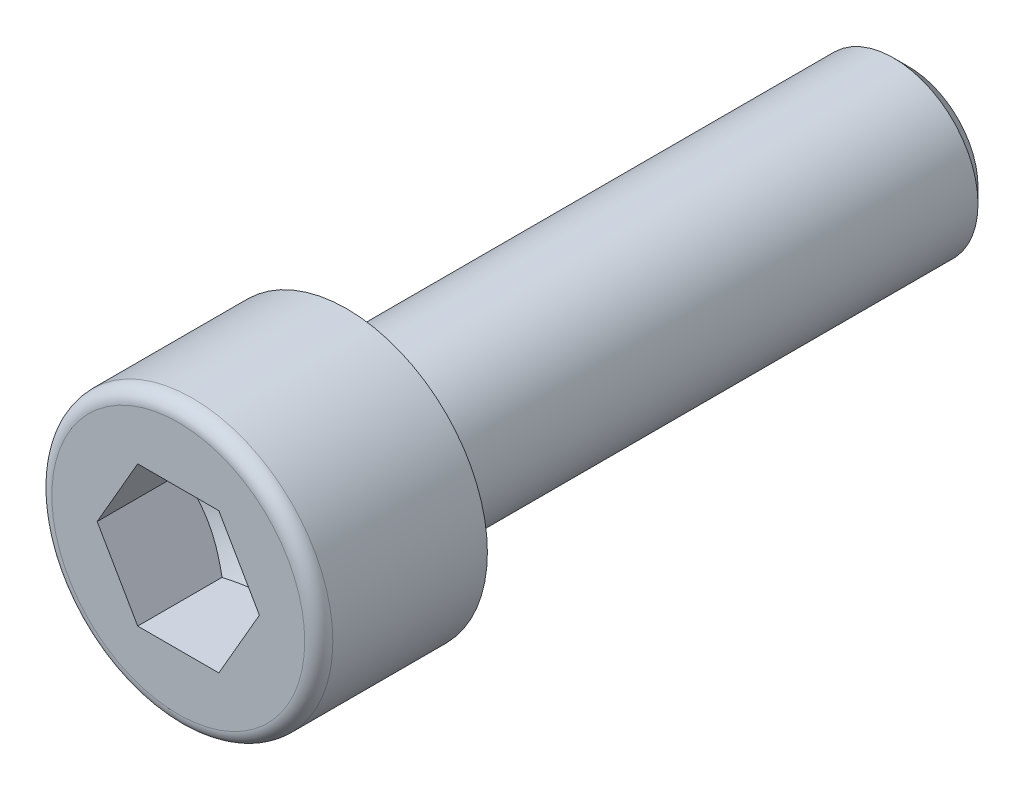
ISO-10303-21;
HEADER;
FILE_DESCRIPTION(('STEP AP214'),'2;1');
FILE_NAME('part.step','',(''),(''),'','','');
FILE_SCHEMA(('AUTOMOTIVE_DESIGN { 1 0 10303 214 1 1 1 1 }'));
ENDSEC;
DATA;
#1=APPLICATION_CONTEXT('core data for automotive mechanical design processes');
#2=APPLICATION_PROTOCOL_DEFINITION('international standard','automotive_design',2000,#1);
#3=PRODUCT_CONTEXT('',#1,'mechanical');
#4=PRODUCT('Part','Part','',(#3));
#5=PRODUCT_RELATED_PRODUCT_CATEGORY('part','',(#4));
#6=PRODUCT_DEFINITION_FORMATION('','',#4);
#7=PRODUCT_DEFINITION_CONTEXT('part definition',#1,'design');
#8=PRODUCT_DEFINITION('design','',#6,#7);
#9=PRODUCT_DEFINITION_SHAPE('','',#8);
#10=(LENGTH_UNIT() NAMED_UNIT(*) SI_UNIT(.MILLI.,.METRE.));
#11=(NAMED_UNIT(*) PLANE_ANGLE_UNIT() SI_UNIT($,.RADIAN.));
#12=(NAMED_UNIT(*) SI_UNIT($,.STERADIAN.) SOLID_ANGLE_UNIT());
#13=UNCERTAINTY_MEASURE_WITH_UNIT(LENGTH_MEASURE(1.E-05),#10,'distance_accuracy_value','');
#14=(GEOMETRIC_REPRESENTATION_CONTEXT(3) GLOBAL_UNCERTAINTY_ASSIGNED_CONTEXT((#13)) GLOBAL_UNIT_ASSIGNED_CONTEXT((#10,
#11,#12)) REPRESENTATION_CONTEXT('',''));
#15=CARTESIAN_POINT('',(0.,0.,0.));
#16=DIRECTION('',(0.,0.,1.));
#17=DIRECTION('',(1.,0.,0.));
#18=AXIS2_PLACEMENT_3D('',#15,#16,#17);
#19=CARTESIAN_POINT('',(0.,0.,6.));
#20=DIRECTION('',(0.,0.,1.));
#21=DIRECTION('',(1.,0.,0.));
#22=AXIS2_PLACEMENT_3D('',#19,#20,#21);
#23=PLANE('',#22);
#24=CARTESIAN_POINT('',(0.,0.,6.));
#25=DIRECTION('',(0.,0.,1.));
#26=DIRECTION('',(1.,0.,0.));
#27=AXIS2_PLACEMENT_3D('',#24,#25,#26);
#28=CIRCLE('',#27,4.5);
#29=CARTESIAN_POINT('',(4.5,0.,6.));
#30=VERTEX_POINT('',#29);
#31=EDGE_CURVE('E118',#30,#30,#28,.T.);
#32=ORIENTED_EDGE('',*,*,#31,.T.);
#33=EDGE_LOOP('',(#32));
#34=FACE_BOUND('',#33,.T.);
#35=DIRECTION('',(1.,0.,0.));
#36=VECTOR('',#35,1.);
#37=CARTESIAN_POINT('',(-1.443375,2.49999883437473,6.));
#38=LINE('',#37,#36);
#39=CARTESIAN_POINT('',(-1.443375,2.49999883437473,6.));
#40=VERTEX_POINT('',#39);
#41=CARTESIAN_POINT('',(1.443375,2.49999883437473,6.));
#42=VERTEX_POINT('',#41);
#43=EDGE_CURVE('E95',#40,#42,#38,.T.);
#44=ORIENTED_EDGE('',*,*,#43,.T.);
#45=DIRECTION('',(0.5,-0.866025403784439,0.));
#46=VECTOR('',#45,1.);
#47=CARTESIAN_POINT('',(1.443375,2.49999883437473,6.));
#48=LINE('',#47,#46);
#49=CARTESIAN_POINT('',(2.88675,0.,6.));
#50=VERTEX_POINT('',#49);
#51=EDGE_CURVE('E32',#42,#50,#48,.T.);
#52=ORIENTED_EDGE('',*,*,#51,.T.);
#53=DIRECTION('',(-0.5,-0.866025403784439,0.));
#54=VECTOR('',#53,1.);
#55=CARTESIAN_POINT('',(2.88675,0.,6.));
#56=LINE('',#55,#54);
#57=CARTESIAN_POINT('',(1.443375,-2.49999883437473,6.));
#58=VERTEX_POINT('',#57);
#59=EDGE_CURVE('E375',#50,#58,#56,.T.);
#60=ORIENTED_EDGE('',*,*,#59,.T.);
#61=DIRECTION('',(-1.,0.,0.));
#62=VECTOR('',#61,1.);
#63=CARTESIAN_POINT('',(1.443375,-2.49999883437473,6.));
#64=LINE('',#63,#62);
#65=CARTESIAN_POINT('',(-1.443375,-2.49999883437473,6.));
#66=VERTEX_POINT('',#65);
#67=EDGE_CURVE('E379',#58,#66,#64,.T.);
#68=ORIENTED_EDGE('',*,*,#67,.T.);
#69=DIRECTION('',(-0.5,0.866025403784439,0.));
#70=VECTOR('',#69,1.);
#71=CARTESIAN_POINT('',(-1.443375,-2.49999883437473,6.));
#72=LINE('',#71,#70);
#73=CARTESIAN_POINT('',(-2.88675,0.,6.));
#74=VERTEX_POINT('',#73);
#75=EDGE_CURVE('E383',#66,#74,#72,.T.);
#76=ORIENTED_EDGE('',*,*,#75,.T.);
#77=DIRECTION('',(0.5,0.866025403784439,0.));
#78=VECTOR('',#77,1.);
#79=CARTESIAN_POINT('',(-2.88675,0.,6.));
#80=LINE('',#79,#78);
#81=EDGE_CURVE('E104',#74,#40,#80,.T.);
#82=ORIENTED_EDGE('',*,*,#81,.T.);
#83=EDGE_LOOP('',(#44,#52,#60,#68,#76,#82));
#84=FACE_BOUND('',#83,.T.);
#85=ADVANCED_FACE('F16',(#34,#84),#23,.T.);
#86=CARTESIAN_POINT('',(0.,2.45875,-20.));
#87=DIRECTION('',(0.,0.,-1.));
#88=DIRECTION('',(-1.,0.,0.));
#89=AXIS2_PLACEMENT_3D('',#86,#87,#88);
#90=PLANE('',#89);
#91=CARTESIAN_POINT('',(0.,0.,-20.));
#92=DIRECTION('',(0.,0.,1.));
#93=DIRECTION('',(1.,0.,0.));
#94=AXIS2_PLACEMENT_3D('',#91,#92,#93);
#95=CIRCLE('',#94,2.45875);
#96=CARTESIAN_POINT('',(2.45875,0.,-20.));
#97=VERTEX_POINT('',#96);
#98=EDGE_CURVE('E11',#97,#97,#95,.T.);
#99=ORIENTED_EDGE('',*,*,#98,.F.);
#100=EDGE_LOOP('',(#99));
#101=FACE_BOUND('',#100,.T.);
#102=ADVANCED_FACE('F18',(#101),#90,.T.);
#103=CARTESIAN_POINT('',(0.,0.,-19.45875));
#104=DIRECTION('',(0.,0.,1.));
#105=DIRECTION('',(1.,0.,0.));
#106=AXIS2_PLACEMENT_3D('',#103,#104,#105);
#107=CONICAL_SURFACE('',#106,3.,0.785398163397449);
#108=ORIENTED_EDGE('',*,*,#98,.T.);
#109=EDGE_LOOP('',(#108));
#110=FACE_BOUND('',#109,.T.);
#111=CARTESIAN_POINT('',(0.,0.,-19.45875));
#112=DIRECTION('',(0.,0.,1.));
#113=DIRECTION('',(1.,0.,0.));
#114=AXIS2_PLACEMENT_3D('',#111,#112,#113);
#115=CIRCLE('',#114,3.);
#116=CARTESIAN_POINT('',(3.,0.,-19.45875));
#117=VERTEX_POINT('',#116);
#118=EDGE_CURVE('E25',#117,#117,#115,.T.);
#119=ORIENTED_EDGE('',*,*,#118,.F.);
#120=EDGE_LOOP('',(#119));
#121=FACE_BOUND('',#120,.T.);
#122=ADVANCED_FACE('F159',(#110,#121),#107,.T.);
#123=CARTESIAN_POINT('',(0.,0.,6.));
#124=DIRECTION('',(0.,0.,1.));
#125=DIRECTION('',(1.,0.,0.));
#126=AXIS2_PLACEMENT_3D('',#123,#124,#125);
#127=CYLINDRICAL_SURFACE('',#126,3.);
#128=ORIENTED_EDGE('',*,*,#118,.T.);
#129=EDGE_LOOP('',(#128));
#130=FACE_BOUND('',#129,.T.);
#131=CARTESIAN_POINT('',(0.,0.,-0.89125));
#132=DIRECTION('',(0.,0.,1.));
#133=DIRECTION('',(1.,0.,0.));
#134=AXIS2_PLACEMENT_3D('',#131,#132,#133);
#135=CIRCLE('',#134,3.);
#136=CARTESIAN_POINT('',(3.,0.,-0.89125));
#137=VERTEX_POINT('',#136);
#138=EDGE_CURVE('E146',#137,#137,#135,.T.);
#139=ORIENTED_EDGE('',*,*,#138,.F.);
#140=EDGE_LOOP('',(#139));
#141=FACE_BOUND('',#140,.T.);
#142=ADVANCED_FACE('F156',(#130,#141),#127,.T.);
#143=CARTESIAN_POINT('',(0.,2.45875,-0.89125));
#144=DIRECTION('',(0.,0.,1.));
#145=DIRECTION('',(1.,0.,0.));
#146=AXIS2_PLACEMENT_3D('',#143,#144,#145);
#147=PLANE('',#146);
#148=ORIENTED_EDGE('',*,*,#138,.T.);
#149=EDGE_LOOP('',(#148));
#150=FACE_BOUND('',#149,.T.);
#151=CARTESIAN_POINT('',(0.,0.,-0.89125));
#152=DIRECTION('',(0.,0.,1.));
#153=DIRECTION('',(1.,0.,0.));
#154=AXIS2_PLACEMENT_3D('',#151,#152,#153);
#155=CIRCLE('',#154,2.45875);
#156=CARTESIAN_POINT('',(2.45875,0.,-0.89125));
#157=VERTEX_POINT('',#156);
#158=EDGE_CURVE('E142',#157,#157,#155,.T.);
#159=ORIENTED_EDGE('',*,*,#158,.F.);
#160=EDGE_LOOP('',(#159));
#161=FACE_BOUND('',#160,.T.);
#162=ADVANCED_FACE('F167',(#150,#161),#147,.T.);
#163=CARTESIAN_POINT('',(0.,0.,-0.35));
#164=DIRECTION('',(0.,0.,1.));
#165=DIRECTION('',(1.,0.,0.));
#166=AXIS2_PLACEMENT_3D('',#163,#164,#165);
#167=CONICAL_SURFACE('',#166,3.,0.785398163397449);
#168=ORIENTED_EDGE('',*,*,#158,.T.);
#169=EDGE_LOOP('',(#168));
#170=FACE_BOUND('',#169,.T.);
#171=CARTESIAN_POINT('',(0.,0.,-0.35));
#172=DIRECTION('',(0.,0.,1.));
#173=DIRECTION('',(1.,0.,0.));
#174=AXIS2_PLACEMENT_3D('',#171,#172,#173);
#175=CIRCLE('',#174,3.);
#176=CARTESIAN_POINT('',(3.,0.,-0.35));
#177=VERTEX_POINT('',#176);
#178=EDGE_CURVE('E138',#177,#177,#175,.T.);
#179=ORIENTED_EDGE('',*,*,#178,.F.);
#180=EDGE_LOOP('',(#179));
#181=FACE_BOUND('',#180,.T.);
#182=ADVANCED_FACE('F199',(#170,#181),#167,.T.);
#183=CARTESIAN_POINT('',(0.,0.,6.));
#184=DIRECTION('',(0.,0.,1.));
#185=DIRECTION('',(1.,0.,0.));
#186=AXIS2_PLACEMENT_3D('',#183,#184,#185);
#187=CYLINDRICAL_SURFACE('',#186,3.);
#188=ORIENTED_EDGE('',*,*,#178,.T.);
#189=EDGE_LOOP('',(#188));
#190=FACE_BOUND('',#189,.T.);
#191=CARTESIAN_POINT('',(0.,0.,-0.3));
#192=DIRECTION('',(0.,0.,1.));
#193=DIRECTION('',(1.,0.,0.));
#194=AXIS2_PLACEMENT_3D('',#191,#192,#193);
#195=CIRCLE('',#194,3.);
#196=CARTESIAN_POINT('',(3.,0.,-0.3));
#197=VERTEX_POINT('',#196);
#198=EDGE_CURVE('E134',#197,#197,#195,.T.);
#199=ORIENTED_EDGE('',*,*,#198,.F.);
#200=EDGE_LOOP('',(#199));
#201=FACE_BOUND('',#200,.T.);
#202=ADVANCED_FACE('F195',(#190,#201),#187,.T.);
#203=CARTESIAN_POINT('',(0.,0.,-0.3));
#204=DIRECTION('',(0.,0.,1.));
#205=DIRECTION('',(1.,0.,0.));
#206=AXIS2_PLACEMENT_3D('',#203,#204,#205);
#207=TOROIDAL_SURFACE('',#206,3.3,0.3);
#208=ORIENTED_EDGE('',*,*,#198,.T.);
#209=EDGE_LOOP('',(#208));
#210=FACE_BOUND('',#209,.T.);
#211=CARTESIAN_POINT('',(0.,0.,0.));
#212=DIRECTION('',(0.,0.,1.));
#213=DIRECTION('',(1.,0.,0.));
#214=AXIS2_PLACEMENT_3D('',#211,#212,#213);
#215=CIRCLE('',#214,3.3);
#216=CARTESIAN_POINT('',(3.3,0.,0.));
#217=VERTEX_POINT('',#216);
#218=EDGE_CURVE('E130',#217,#217,#215,.T.);
#219=ORIENTED_EDGE('',*,*,#218,.F.);
#220=EDGE_LOOP('',(#219));
#221=FACE_BOUND('',#220,.T.);
#222=ADVANCED_FACE('F191',(#210,#221),#207,.F.);
#223=CARTESIAN_POINT('',(0.,5.,0.));
#224=DIRECTION('',(0.,0.,-1.));
#225=DIRECTION('',(-1.,0.,0.));
#226=AXIS2_PLACEMENT_3D('',#223,#224,#225);
#227=PLANE('',#226);
#228=ORIENTED_EDGE('',*,*,#218,.T.);
#229=EDGE_LOOP('',(#228));
#230=FACE_BOUND('',#229,.T.);
#231=CARTESIAN_POINT('',(0.,0.,0.));
#232=DIRECTION('',(0.,0.,1.));
#233=DIRECTION('',(1.,0.,0.));
#234=AXIS2_PLACEMENT_3D('',#231,#232,#233);
#235=CIRCLE('',#234,5.);
#236=CARTESIAN_POINT('',(5.,0.,0.));
#237=VERTEX_POINT('',#236);
#238=EDGE_CURVE('E126',#237,#237,#235,.T.);
#239=ORIENTED_EDGE('',*,*,#238,.F.);
#240=EDGE_LOOP('',(#239));
#241=FACE_BOUND('',#240,.T.);
#242=ADVANCED_FACE('F187',(#230,#241),#227,.T.);
#243=CARTESIAN_POINT('',(0.,0.,6.));
#244=DIRECTION('',(0.,0.,1.));
#245=DIRECTION('',(1.,0.,0.));
#246=AXIS2_PLACEMENT_3D('',#243,#244,#245);
#247=CYLINDRICAL_SURFACE('',#246,5.);
#248=ORIENTED_EDGE('',*,*,#238,.T.);
#249=EDGE_LOOP('',(#248));
#250=FACE_BOUND('',#249,.T.);
#251=CARTESIAN_POINT('',(0.,0.,5.5));
#252=DIRECTION('',(0.,0.,1.));
#253=DIRECTION('',(1.,0.,0.));
#254=AXIS2_PLACEMENT_3D('',#251,#252,#253);
#255=CIRCLE('',#254,5.);
#256=CARTESIAN_POINT('',(5.,0.,5.5));
#257=VERTEX_POINT('',#256);
#258=EDGE_CURVE('E122',#257,#257,#255,.T.);
#259=ORIENTED_EDGE('',*,*,#258,.F.);
#260=EDGE_LOOP('',(#259));
#261=FACE_BOUND('',#260,.T.);
#262=ADVANCED_FACE('F183',(#250,#261),#247,.T.);
#263=CARTESIAN_POINT('',(0.,0.,5.5));
#264=DIRECTION('',(0.,0.,1.));
#265=DIRECTION('',(1.,0.,0.));
#266=AXIS2_PLACEMENT_3D('',#263,#264,#265);
#267=TOROIDAL_SURFACE('',#266,4.5,0.5);
#268=ORIENTED_EDGE('',*,*,#31,.F.);
#269=EDGE_LOOP('',(#268));
#270=FACE_BOUND('',#269,.T.);
#271=ORIENTED_EDGE('',*,*,#258,.T.);
#272=EDGE_LOOP('',(#271));
#273=FACE_BOUND('',#272,.T.);
#274=ADVANCED_FACE('F180',(#270,#273),#267,.T.);
#275=CARTESIAN_POINT('',(1.443375,2.49999883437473,1.33333411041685));
#276=DIRECTION('',(-0.866025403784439,-0.5,0.));
#277=DIRECTION('',(-0.5,0.866025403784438,0.));
#278=AXIS2_PLACEMENT_3D('',#275,#276,#277);
#279=PLANE('',#278);
#280=DIRECTION('',(0.,0.,1.));
#281=VECTOR('',#280,1.);
#282=CARTESIAN_POINT('',(2.88675,0.,1.33333411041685));
#283=LINE('',#282,#281);
#284=CARTESIAN_POINT('',(2.88675,0.,3.));
#285=VERTEX_POINT('',#284);
#286=EDGE_CURVE('E116',#285,#50,#283,.T.);
#287=ORIENTED_EDGE('',*,*,#286,.T.);
#288=ORIENTED_EDGE('',*,*,#51,.F.);
#289=DIRECTION('',(0.,0.,1.));
#290=VECTOR('',#289,1.);
#291=CARTESIAN_POINT('',(1.443375,2.49999883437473,1.33333411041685));
#292=LINE('',#291,#290);
#293=CARTESIAN_POINT('',(1.443375,2.49999883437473,3.));
#294=VERTEX_POINT('',#293);
#295=EDGE_CURVE('E88',#294,#42,#292,.T.);
#296=ORIENTED_EDGE('',*,*,#295,.F.);
#297=CARTESIAN_POINT('',(2.88675115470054,-2.E-06,3.00000066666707));
#298=CARTESIAN_POINT('',(2.82332354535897,0.109857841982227,2.96337006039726));
#299=CARTESIAN_POINT('',(2.75934842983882,0.220665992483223,2.93005643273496));
#300=CARTESIAN_POINT('',(2.63029051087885,0.444200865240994,2.87190847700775));
#301=CARTESIAN_POINT('',(2.56520541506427,0.556931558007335,2.84709471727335));
#302=CARTESIAN_POINT('',(2.4358417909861,0.78099592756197,2.8084702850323));
#303=CARTESIAN_POINT('',(2.37158316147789,0.892295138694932,2.79440251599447));
#304=CARTESIAN_POINT('',(2.24276369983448,1.11541699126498,2.77761163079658));
#305=CARTESIAN_POINT('',(2.17820333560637,1.22723882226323,2.77487460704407));
#306=CARTESIAN_POINT('',(2.05757906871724,1.43616618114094,2.7805828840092));
#307=CARTESIAN_POINT('',(2.00149706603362,1.53330305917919,2.78762661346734));
#308=CARTESIAN_POINT('',(1.88969841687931,1.72694399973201,2.8099466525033));
#309=CARTESIAN_POINT('',(1.83398215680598,1.82344739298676,2.82523057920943));
#310=CARTESIAN_POINT('',(1.72195318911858,2.01748725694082,2.86343746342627));
#311=CARTESIAN_POINT('',(1.66565465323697,2.1149991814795,2.88652230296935));
#312=CARTESIAN_POINT('',(1.55389703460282,2.30856905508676,2.93891513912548));
#313=CARTESIAN_POINT('',(1.49843652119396,2.40462948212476,2.96821083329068));
#314=CARTESIAN_POINT('',(1.44337384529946,2.50000083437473,3.00000066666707));
#315=B_SPLINE_CURVE_WITH_KNOTS('',3,(#297,#298,#299,#300,#301,#302,#303,#304,#305,#306,#307,
#308,#309,#310,#311,#312,#313,#314),.UNSPECIFIED.,.F.,.F.,(4,2,2,2,2,2,2,2,4),(0.,
0.396269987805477,0.793492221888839,1.1808844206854,1.56780098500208,1.90463546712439,
2.24178184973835,2.58640455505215,2.93035090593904),.UNSPECIFIED.);
#316=EDGE_CURVE('E80',#285,#294,#315,.T.);
#317=ORIENTED_EDGE('',*,*,#316,.F.);
#318=EDGE_LOOP('',(#287,#288,#296,#317));
#319=FACE_BOUND('',#318,.T.);
#320=ADVANCED_FACE('F89',(#319),#279,.T.);
#321=CARTESIAN_POINT('',(2.88675,0.,1.33333411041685));
#322=DIRECTION('',(-0.866025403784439,0.5,0.));
#323=DIRECTION('',(0.5,0.866025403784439,0.));
#324=AXIS2_PLACEMENT_3D('',#321,#322,#323);
#325=PLANE('',#324);
#326=DIRECTION('',(0.,0.,1.));
#327=VECTOR('',#326,1.);
#328=CARTESIAN_POINT('',(1.443375,-2.49999883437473,1.33333411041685));
#329=LINE('',#328,#327);
#330=CARTESIAN_POINT('',(1.443375,-2.49999883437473,3.));
#331=VERTEX_POINT('',#330);
#332=EDGE_CURVE('E113',#331,#58,#329,.T.);
#333=ORIENTED_EDGE('',*,*,#332,.T.);
#334=ORIENTED_EDGE('',*,*,#59,.F.);
#335=ORIENTED_EDGE('',*,*,#286,.F.);
#336=CARTESIAN_POINT('',(1.44337384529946,-2.50000083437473,3.00000066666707));
#337=CARTESIAN_POINT('',(1.50680145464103,-2.3901409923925,2.96337006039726));
#338=CARTESIAN_POINT('',(1.57077657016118,-2.27933284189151,2.93005643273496));
#339=CARTESIAN_POINT('',(1.69983448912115,-2.05579796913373,2.87190847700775));
#340=CARTESIAN_POINT('',(1.76491958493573,-1.94306727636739,2.84709471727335));
#341=CARTESIAN_POINT('',(1.8942832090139,-1.71900290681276,2.8084702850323));
#342=CARTESIAN_POINT('',(1.95854183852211,-1.6077036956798,2.79440251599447));
#343=CARTESIAN_POINT('',(2.08736130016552,-1.38458184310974,2.77761163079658));
#344=CARTESIAN_POINT('',(2.15192166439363,-1.2727600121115,2.77487460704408));
#345=CARTESIAN_POINT('',(2.27254593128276,-1.06383265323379,2.7805828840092));
#346=CARTESIAN_POINT('',(2.32862793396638,-0.966695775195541,2.78762661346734));
#347=CARTESIAN_POINT('',(2.44042658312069,-0.773054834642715,2.8099466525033));
#348=CARTESIAN_POINT('',(2.49614284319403,-0.676551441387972,2.82523057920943));
#349=CARTESIAN_POINT('',(2.60817181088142,-0.482511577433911,2.86343746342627));
#350=CARTESIAN_POINT('',(2.66447034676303,-0.384999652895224,2.88652230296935));
#351=CARTESIAN_POINT('',(2.77622796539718,-0.191429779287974,2.93891513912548));
#352=CARTESIAN_POINT('',(2.83168847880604,-0.0953693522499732,2.96821083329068));
#353=CARTESIAN_POINT('',(2.88675115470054,2.00000000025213E-06,3.00000066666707));
#354=B_SPLINE_CURVE_WITH_KNOTS('',3,(#336,#337,#338,#339,#340,#341,#342,#343,#344,#345,#346,
#347,#348,#349,#350,#351,#352,#353),.UNSPECIFIED.,.F.,.F.,(4,2,2,2,2,2,2,2,4),(0.,
0.396269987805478,0.79349222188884,1.1808844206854,1.56780098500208,1.90463546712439,
2.24178184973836,2.58640455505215,2.93035090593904),.UNSPECIFIED.);
#355=EDGE_CURVE('E84',#331,#285,#354,.T.);
#356=ORIENTED_EDGE('',*,*,#355,.F.);
#357=EDGE_LOOP('',(#333,#334,#335,#356));
#358=FACE_BOUND('',#357,.T.);
#359=ADVANCED_FACE('F264',(#358),#325,.T.);
#360=CARTESIAN_POINT('',(1.443375,-2.49999883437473,1.33333411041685));
#361=DIRECTION('',(0.,1.,0.));
#362=DIRECTION('',(1.,0.,0.));
#363=AXIS2_PLACEMENT_3D('',#360,#361,#362);
#364=PLANE('',#363);
#365=DIRECTION('',(0.,0.,1.));
#366=VECTOR('',#365,1.);
#367=CARTESIAN_POINT('',(-1.443375,-2.49999883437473,1.33333411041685));
#368=LINE('',#367,#366);
#369=CARTESIAN_POINT('',(-1.443375,-2.49999883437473,3.));
#370=VERTEX_POINT('',#369);
#371=EDGE_CURVE('E110',#370,#66,#368,.T.);
#372=ORIENTED_EDGE('',*,*,#371,.T.);
#373=ORIENTED_EDGE('',*,*,#67,.F.);
#374=ORIENTED_EDGE('',*,*,#332,.F.);
#375=CARTESIAN_POINT('',(-3.73786106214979,-2.49999883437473,3.92958778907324));
#376=CARTESIAN_POINT('',(-3.62990250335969,-2.49999883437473,3.87779335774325));
#377=CARTESIAN_POINT('',(-3.52168094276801,-2.49999883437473,3.82653690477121));
#378=CARTESIAN_POINT('',(-3.30457164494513,-2.49999883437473,3.72540514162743));
#379=CARTESIAN_POINT('',(-3.19568379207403,-2.49999883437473,3.67553008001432));
#380=CARTESIAN_POINT('',(-2.9764774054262,-2.49999883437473,3.57718765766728));
#381=CARTESIAN_POINT('',(-2.86615419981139,-2.49999883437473,3.52873067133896));
#382=CARTESIAN_POINT('',(-2.64458202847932,-2.49999883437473,3.4339896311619));
#383=CARTESIAN_POINT('',(-2.53333311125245,-2.49999883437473,3.38770546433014));
#384=CARTESIAN_POINT('',(-2.30680205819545,-2.49999883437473,3.2967100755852));
#385=CARTESIAN_POINT('',(-2.19149052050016,-2.49999883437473,3.2520716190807));
#386=CARTESIAN_POINT('',(-1.95947266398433,-2.49999883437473,3.1665059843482));
#387=CARTESIAN_POINT('',(-1.84276618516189,-2.49999883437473,3.12557923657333));
#388=CARTESIAN_POINT('',(-1.60804233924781,-2.49999883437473,3.04860739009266));
#389=CARTESIAN_POINT('',(-1.49002871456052,-2.49999883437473,3.01255100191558));
#390=CARTESIAN_POINT('',(-1.25231014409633,-2.49999883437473,2.94655294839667));
#391=CARTESIAN_POINT('',(-1.13260562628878,-2.49999883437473,2.91660976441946));
#392=CARTESIAN_POINT('',(-0.891754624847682,-2.49999883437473,2.86443431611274));
#393=CARTESIAN_POINT('',(-0.770611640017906,-2.49999883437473,2.84218621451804));
#394=CARTESIAN_POINT('',(-0.526970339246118,-2.49999883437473,2.8068577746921));
#395=CARTESIAN_POINT('',(-0.404472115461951,-2.49999883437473,2.79377681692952));
#396=CARTESIAN_POINT('',(-0.160266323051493,-2.49999883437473,2.7779963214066));
#397=CARTESIAN_POINT('',(-0.0385668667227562,-2.49999883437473,2.77517427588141));
#398=CARTESIAN_POINT('',(0.204641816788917,-2.49999883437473,2.77983589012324));
#399=CARTESIAN_POINT('',(0.326151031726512,-2.49999883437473,2.78732018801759));
#400=CARTESIAN_POINT('',(0.536550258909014,-2.49999883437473,2.80869871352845));
#401=CARTESIAN_POINT('',(0.62567290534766,-2.49999883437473,2.82040889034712));
#402=CARTESIAN_POINT('',(0.80317291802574,-2.49999883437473,2.84856827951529));
#403=CARTESIAN_POINT('',(0.89155015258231,-2.49999883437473,2.86501831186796));
#404=CARTESIAN_POINT('',(1.15551819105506,-2.49999883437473,2.920608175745));
#405=CARTESIAN_POINT('',(1.32980784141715,-2.49999883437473,2.96597208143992));
#406=CARTESIAN_POINT('',(1.59042319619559,-2.49999883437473,3.04347409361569));
#407=CARTESIAN_POINT('',(1.6781227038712,-2.49999883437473,3.07124565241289));
#408=CARTESIAN_POINT('',(1.85261386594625,-2.49999883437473,3.12935698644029));
#409=CARTESIAN_POINT('',(1.93940604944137,-2.49999883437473,3.15969515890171));
#410=CARTESIAN_POINT('',(2.11219208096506,-2.49999883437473,3.2225001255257));
#411=CARTESIAN_POINT('',(2.19818607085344,-2.49999883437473,3.25496653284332));
#412=CARTESIAN_POINT('',(2.36949689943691,-2.49999883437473,3.32167630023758));
#413=CARTESIAN_POINT('',(2.4548136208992,-2.49999883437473,3.35591996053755));
#414=CARTESIAN_POINT('',(2.6725866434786,-2.49999883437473,3.44552247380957));
#415=CARTESIAN_POINT('',(2.80460719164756,-2.49999883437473,3.50193903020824));
#416=CARTESIAN_POINT('',(3.06745887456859,-2.49999883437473,3.61748626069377));
#417=CARTESIAN_POINT('',(3.19828991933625,-2.49999883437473,3.6766171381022));
#418=CARTESIAN_POINT('',(3.4590085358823,-2.49999883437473,3.79697662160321));
#419=CARTESIAN_POINT('',(3.58889593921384,-2.49999883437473,3.85820559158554));
#420=CARTESIAN_POINT('',(3.84788850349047,-2.49999883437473,3.98229871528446));
#421=CARTESIAN_POINT('',(3.97699364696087,-2.49999883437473,4.04516290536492));
#422=CARTESIAN_POINT('',(4.36366797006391,-2.49999883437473,4.23583166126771));
#423=CARTESIAN_POINT('',(4.62028446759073,-2.49999883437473,4.36556642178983));
#424=CARTESIAN_POINT('',(5.13176042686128,-2.49999883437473,4.62835386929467));
#425=CARTESIAN_POINT('',(5.38662010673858,-2.49999883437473,4.76140613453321));
#426=CARTESIAN_POINT('',(5.87112459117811,-2.49999883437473,5.01714634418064));
#427=CARTESIAN_POINT('',(6.10087887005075,-2.49999883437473,5.13962722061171));
#428=CARTESIAN_POINT('',(6.55964844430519,-2.49999883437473,5.38598343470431));
#429=CARTESIAN_POINT('',(6.78866371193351,-2.49999883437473,5.50985882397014));
#430=CARTESIAN_POINT('',(7.2455430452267,-2.49999883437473,5.75833902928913));
#431=CARTESIAN_POINT('',(7.47340855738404,-2.49999883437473,5.88294118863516));
#432=CARTESIAN_POINT('',(7.9286788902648,-2.49999883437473,6.13295649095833));
#433=CARTESIAN_POINT('',(8.156083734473,-2.49999883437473,6.25836959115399));
#434=CARTESIAN_POINT('',(8.38332307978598,-2.49999883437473,6.38407993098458));
#435=B_SPLINE_CURVE_WITH_KNOTS('',3,(#375,#376,#377,#378,#379,#380,#381,#382,#383,#384,#385,
#386,#387,#388,#389,#390,#391,#392,#393,#394,#395,#396,#397,#398,#399,#400,#401,#402,#403,#404,
#405,#406,#407,#408,#409,#410,#411,#412,#413,#414,#415,#416,#417,#418,#419,#420,#421,#422,#423,
#424,#425,#426,#427,#428,#429,#430,#431,#432,#433,#434),.UNSPECIFIED.,.F.,.F.,(4,2,2,2,2,2,2,2,
2,2,2,2,2,2,2,2,2,2,2,2,2,2,2,2,2,2,2,2,2,4),(0.,0.359225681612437,0.718515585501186,
1.07998495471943,1.44143550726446,1.81233642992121,2.18328031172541,2.553349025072,
2.92332569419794,3.29253631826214,3.66172198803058,4.02648423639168,4.39126907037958,
4.66080188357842,4.93038135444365,5.4699536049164,5.74590907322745,6.02169347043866,
6.29742787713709,6.57320901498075,7.00387400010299,7.43457129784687,7.86534367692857,
8.29612564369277,9.15872160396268,10.0212084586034,10.8022892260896,11.5833989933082,
12.3625220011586,13.1416042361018),.UNSPECIFIED.);
#436=EDGE_CURVE('E330',#370,#331,#435,.T.);
#437=ORIENTED_EDGE('',*,*,#436,.F.);
#438=EDGE_LOOP('',(#372,#373,#374,#437));
#439=FACE_BOUND('',#438,.T.);
#440=ADVANCED_FACE('F271',(#439),#364,.T.);
#441=CARTESIAN_POINT('',(-1.443375,-2.49999883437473,1.33333411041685));
#442=DIRECTION('',(0.866025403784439,0.5,0.));
#443=DIRECTION('',(0.5,-0.866025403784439,0.));
#444=AXIS2_PLACEMENT_3D('',#441,#442,#443);
#445=PLANE('',#444);
#446=DIRECTION('',(0.,0.,1.));
#447=VECTOR('',#446,1.);
#448=CARTESIAN_POINT('',(-2.88675,0.,1.33333411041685));
#449=LINE('',#448,#447);
#450=CARTESIAN_POINT('',(-2.88675,0.,3.));
#451=VERTEX_POINT('',#450);
#452=EDGE_CURVE('E101',#451,#74,#449,.T.);
#453=ORIENTED_EDGE('',*,*,#452,.T.);
#454=ORIENTED_EDGE('',*,*,#75,.F.);
#455=ORIENTED_EDGE('',*,*,#371,.F.);
#456=CARTESIAN_POINT('',(-2.88675115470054,2.00000000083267E-06,3.00000066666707));
#457=CARTESIAN_POINT('',(-2.82332354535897,-0.109857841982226,2.96337006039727));
#458=CARTESIAN_POINT('',(-2.75934842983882,-0.220665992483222,2.93005643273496));
#459=CARTESIAN_POINT('',(-2.63029051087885,-0.444200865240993,2.87190847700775));
#460=CARTESIAN_POINT('',(-2.56520541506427,-0.556931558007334,2.84709471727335));
#461=CARTESIAN_POINT('',(-2.4358417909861,-0.780995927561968,2.8084702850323));
#462=CARTESIAN_POINT('',(-2.37158316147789,-0.89229513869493,2.79440251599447));
#463=CARTESIAN_POINT('',(-2.24276369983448,-1.11541699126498,2.77761163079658));
#464=CARTESIAN_POINT('',(-2.17820333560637,-1.22723882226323,2.77487460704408));
#465=CARTESIAN_POINT('',(-2.05757906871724,-1.43616618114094,2.7805828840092));
#466=CARTESIAN_POINT('',(-2.00149706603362,-1.53330305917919,2.78762661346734));
#467=CARTESIAN_POINT('',(-1.88969841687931,-1.72694399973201,2.8099466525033));
#468=CARTESIAN_POINT('',(-1.83398215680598,-1.82344739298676,2.82523057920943));
#469=CARTESIAN_POINT('',(-1.72195318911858,-2.01748725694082,2.86343746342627));
#470=CARTESIAN_POINT('',(-1.66565465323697,-2.1149991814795,2.88652230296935));
#471=CARTESIAN_POINT('',(-1.55389703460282,-2.30856905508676,2.93891513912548));
#472=CARTESIAN_POINT('',(-1.49843652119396,-2.40462948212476,2.96821083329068));
#473=CARTESIAN_POINT('',(-1.44337384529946,-2.50000083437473,3.00000066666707));
#474=B_SPLINE_CURVE_WITH_KNOTS('',3,(#456,#457,#458,#459,#460,#461,#462,#463,#464,#465,#466,
#467,#468,#469,#470,#471,#472,#473),.UNSPECIFIED.,.F.,.F.,(4,2,2,2,2,2,2,2,4),(0.,
0.396269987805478,0.793492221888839,1.1808844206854,1.56780098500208,1.90463546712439,
2.24178184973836,2.58640455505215,2.93035090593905),.UNSPECIFIED.);
#475=EDGE_CURVE('E323',#451,#370,#474,.T.);
#476=ORIENTED_EDGE('',*,*,#475,.F.);
#477=EDGE_LOOP('',(#453,#454,#455,#476));
#478=FACE_BOUND('',#477,.T.);
#479=ADVANCED_FACE('F279',(#478),#445,.T.);
#480=CARTESIAN_POINT('',(-2.88675,0.,1.33333411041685));
#481=DIRECTION('',(0.866025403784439,-0.5,0.));
#482=DIRECTION('',(-0.5,-0.866025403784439,0.));
#483=AXIS2_PLACEMENT_3D('',#480,#481,#482);
#484=PLANE('',#483);
#485=DIRECTION('',(0.,0.,1.));
#486=VECTOR('',#485,1.);
#487=CARTESIAN_POINT('',(-1.443375,2.49999883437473,1.33333411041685));
#488=LINE('',#487,#486);
#489=CARTESIAN_POINT('',(-1.443375,2.49999883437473,3.));
#490=VERTEX_POINT('',#489);
#491=EDGE_CURVE('E94',#490,#40,#488,.T.);
#492=ORIENTED_EDGE('',*,*,#491,.T.);
#493=ORIENTED_EDGE('',*,*,#81,.F.);
#494=ORIENTED_EDGE('',*,*,#452,.F.);
#495=CARTESIAN_POINT('',(-1.44337384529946,2.50000083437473,3.00000066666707));
#496=CARTESIAN_POINT('',(-1.50680145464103,2.3901409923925,2.96337006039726));
#497=CARTESIAN_POINT('',(-1.57077657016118,2.27933284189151,2.93005643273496));
#498=CARTESIAN_POINT('',(-1.69983448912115,2.05579796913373,2.87190847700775));
#499=CARTESIAN_POINT('',(-1.76491958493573,1.94306727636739,2.84709471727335));
#500=CARTESIAN_POINT('',(-1.8942832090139,1.71900290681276,2.8084702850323));
#501=CARTESIAN_POINT('',(-1.95854183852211,1.6077036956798,2.79440251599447));
#502=CARTESIAN_POINT('',(-2.08736130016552,1.38458184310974,2.77761163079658));
#503=CARTESIAN_POINT('',(-2.15192166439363,1.2727600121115,2.77487460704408));
#504=CARTESIAN_POINT('',(-2.27254593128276,1.06383265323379,2.7805828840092));
#505=CARTESIAN_POINT('',(-2.32862793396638,0.966695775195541,2.78762661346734));
#506=CARTESIAN_POINT('',(-2.44042658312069,0.773054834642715,2.8099466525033));
#507=CARTESIAN_POINT('',(-2.49614284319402,0.676551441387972,2.82523057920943));
#508=CARTESIAN_POINT('',(-2.60817181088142,0.482511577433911,2.86343746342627));
#509=CARTESIAN_POINT('',(-2.66447034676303,0.384999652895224,2.88652230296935));
#510=CARTESIAN_POINT('',(-2.77622796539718,0.191429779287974,2.93891513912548));
#511=CARTESIAN_POINT('',(-2.83168847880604,0.0953693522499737,2.96821083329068));
#512=CARTESIAN_POINT('',(-2.88675115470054,-1.9999999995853E-06,3.00000066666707));
#513=B_SPLINE_CURVE_WITH_KNOTS('',3,(#495,#496,#497,#498,#499,#500,#501,#502,#503,#504,#505,
#506,#507,#508,#509,#510,#511,#512),.UNSPECIFIED.,.F.,.F.,(4,2,2,2,2,2,2,2,4),(0.,
0.396269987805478,0.79349222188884,1.1808844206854,1.56780098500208,1.90463546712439,
2.24178184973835,2.58640455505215,2.93035090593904),.UNSPECIFIED.);
#514=EDGE_CURVE('E40',#490,#451,#513,.T.);
#515=ORIENTED_EDGE('',*,*,#514,.F.);
#516=EDGE_LOOP('',(#492,#493,#494,#515));
#517=FACE_BOUND('',#516,.T.);
#518=ADVANCED_FACE('F288',(#517),#484,.T.);
#519=CARTESIAN_POINT('',(-1.443375,2.49999883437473,1.33333411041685));
#520=DIRECTION('',(0.,-1.,0.));
#521=DIRECTION('',(-1.,0.,0.));
#522=AXIS2_PLACEMENT_3D('',#519,#520,#521);
#523=PLANE('',#522);
#524=ORIENTED_EDGE('',*,*,#295,.T.);
#525=ORIENTED_EDGE('',*,*,#43,.F.);
#526=ORIENTED_EDGE('',*,*,#491,.F.);
#527=CARTESIAN_POINT('',(-3.73786106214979,2.49999883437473,3.92958778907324));
#528=CARTESIAN_POINT('',(-3.62990250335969,2.49999883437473,3.87779335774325));
#529=CARTESIAN_POINT('',(-3.52168094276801,2.49999883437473,3.82653690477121));
#530=CARTESIAN_POINT('',(-3.30457164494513,2.49999883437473,3.72540514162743));
#531=CARTESIAN_POINT('',(-3.19568379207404,2.49999883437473,3.67553008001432));
#532=CARTESIAN_POINT('',(-2.9764774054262,2.49999883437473,3.57718765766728));
#533=CARTESIAN_POINT('',(-2.86615419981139,2.49999883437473,3.52873067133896));
#534=CARTESIAN_POINT('',(-2.64458202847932,2.49999883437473,3.4339896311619));
#535=CARTESIAN_POINT('',(-2.53333311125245,2.49999883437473,3.38770546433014));
#536=CARTESIAN_POINT('',(-2.30680205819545,2.49999883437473,3.2967100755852));
#537=CARTESIAN_POINT('',(-2.19149052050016,2.49999883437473,3.2520716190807));
#538=CARTESIAN_POINT('',(-1.95947266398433,2.49999883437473,3.1665059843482));
#539=CARTESIAN_POINT('',(-1.8427661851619,2.49999883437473,3.12557923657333));
#540=CARTESIAN_POINT('',(-1.60804233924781,2.49999883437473,3.04860739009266));
#541=CARTESIAN_POINT('',(-1.49002871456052,2.49999883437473,3.01255100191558));
#542=CARTESIAN_POINT('',(-1.25231014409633,2.49999883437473,2.94655294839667));
#543=CARTESIAN_POINT('',(-1.13260562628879,2.49999883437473,2.91660976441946));
#544=CARTESIAN_POINT('',(-0.891754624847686,2.49999883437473,2.86443431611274));
#545=CARTESIAN_POINT('',(-0.770611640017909,2.49999883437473,2.84218621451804));
#546=CARTESIAN_POINT('',(-0.526970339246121,2.49999883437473,2.8068577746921));
#547=CARTESIAN_POINT('',(-0.404472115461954,2.49999883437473,2.79377681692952));
#548=CARTESIAN_POINT('',(-0.160266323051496,2.49999883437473,2.7779963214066));
#549=CARTESIAN_POINT('',(-0.0385668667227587,2.49999883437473,2.77517427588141));
#550=CARTESIAN_POINT('',(0.204641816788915,2.49999883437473,2.77983589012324));
#551=CARTESIAN_POINT('',(0.326151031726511,2.49999883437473,2.78732018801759));
#552=CARTESIAN_POINT('',(0.536550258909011,2.49999883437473,2.80869871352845));
#553=CARTESIAN_POINT('',(0.625672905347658,2.49999883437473,2.82040889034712));
#554=CARTESIAN_POINT('',(0.803172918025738,2.49999883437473,2.84856827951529));
#555=CARTESIAN_POINT('',(0.891550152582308,2.49999883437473,2.86501831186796));
#556=CARTESIAN_POINT('',(1.15551819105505,2.49999883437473,2.920608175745));
#557=CARTESIAN_POINT('',(1.32980784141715,2.49999883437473,2.96597208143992));
#558=CARTESIAN_POINT('',(1.59042319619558,2.49999883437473,3.04347409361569));
#559=CARTESIAN_POINT('',(1.6781227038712,2.49999883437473,3.07124565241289));
#560=CARTESIAN_POINT('',(1.85261386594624,2.49999883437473,3.12935698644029));
#561=CARTESIAN_POINT('',(1.93940604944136,2.49999883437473,3.15969515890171));
#562=CARTESIAN_POINT('',(2.11219208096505,2.49999883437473,3.2225001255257));
#563=CARTESIAN_POINT('',(2.19818607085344,2.49999883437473,3.25496653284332));
#564=CARTESIAN_POINT('',(2.36949689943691,2.49999883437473,3.32167630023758));
#565=CARTESIAN_POINT('',(2.45481362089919,2.49999883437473,3.35591996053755));
#566=CARTESIAN_POINT('',(2.6725866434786,2.49999883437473,3.44552247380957));
#567=CARTESIAN_POINT('',(2.80460719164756,2.49999883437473,3.50193903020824));
#568=CARTESIAN_POINT('',(3.06745887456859,2.49999883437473,3.61748626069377));
#569=CARTESIAN_POINT('',(3.19828991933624,2.49999883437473,3.6766171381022));
#570=CARTESIAN_POINT('',(3.45900853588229,2.49999883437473,3.79697662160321));
#571=CARTESIAN_POINT('',(3.58889593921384,2.49999883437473,3.85820559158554));
#572=CARTESIAN_POINT('',(3.84788850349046,2.49999883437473,3.98229871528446));
#573=CARTESIAN_POINT('',(3.97699364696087,2.49999883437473,4.04516290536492));
#574=CARTESIAN_POINT('',(4.3636679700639,2.49999883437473,4.23583166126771));
#575=CARTESIAN_POINT('',(4.62028446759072,2.49999883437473,4.36556642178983));
#576=CARTESIAN_POINT('',(5.13176042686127,2.49999883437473,4.62835386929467));
#577=CARTESIAN_POINT('',(5.38662010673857,2.49999883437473,4.7614061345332));
#578=CARTESIAN_POINT('',(5.8711245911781,2.49999883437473,5.01714634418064));
#579=CARTESIAN_POINT('',(6.10087887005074,2.49999883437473,5.13962722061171));
#580=CARTESIAN_POINT('',(6.55964844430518,2.49999883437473,5.38598343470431));
#581=CARTESIAN_POINT('',(6.7886637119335,2.49999883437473,5.50985882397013));
#582=CARTESIAN_POINT('',(7.24554304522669,2.49999883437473,5.75833902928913));
#583=CARTESIAN_POINT('',(7.47340855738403,2.49999883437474,5.88294118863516));
#584=CARTESIAN_POINT('',(7.92867889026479,2.49999883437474,6.13295649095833));
#585=CARTESIAN_POINT('',(8.15608373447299,2.49999883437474,6.25836959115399));
#586=CARTESIAN_POINT('',(8.38332307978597,2.49999883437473,6.38407993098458));
#587=B_SPLINE_CURVE_WITH_KNOTS('',3,(#527,#528,#529,#530,#531,#532,#533,#534,#535,#536,#537,
#538,#539,#540,#541,#542,#543,#544,#545,#546,#547,#548,#549,#550,#551,#552,#553,#554,#555,#556,
#557,#558,#559,#560,#561,#562,#563,#564,#565,#566,#567,#568,#569,#570,#571,#572,#573,#574,#575,
#576,#577,#578,#579,#580,#581,#582,#583,#584,#585,#586),.UNSPECIFIED.,.F.,.F.,(4,2,2,2,2,2,2,2,
2,2,2,2,2,2,2,2,2,2,2,2,2,2,2,2,2,2,2,2,2,4),(0.,0.359225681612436,0.718515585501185,
1.07998495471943,1.44143550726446,1.8123364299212,2.1832803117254,2.553349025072,
2.92332569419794,3.29253631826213,3.66172198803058,4.02648423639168,4.39126907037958,
4.66080188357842,4.93038135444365,5.4699536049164,5.74590907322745,6.02169347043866,
6.29742787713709,6.57320901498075,7.00387400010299,7.43457129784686,7.86534367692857,
8.29612564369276,9.15872160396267,10.0212084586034,10.8022892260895,11.5833989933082,
12.3625220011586,13.1416042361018),.UNSPECIFIED.);
#588=EDGE_CURVE('E81',#294,#490,#587,.F.);
#589=ORIENTED_EDGE('',*,*,#588,.F.);
#590=EDGE_LOOP('',(#524,#525,#526,#589));
#591=FACE_BOUND('',#590,.T.);
#592=ADVANCED_FACE('F76',(#591),#523,.T.);
#593=CARTESIAN_POINT('',(0.,0.,1.33333411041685));
#594=DIRECTION('',(0.,0.,1.));
#595=DIRECTION('',(1.,0.,0.));
#596=AXIS2_PLACEMENT_3D('',#593,#594,#595);
#597=CONICAL_SURFACE('',#596,0.,1.0471975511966);
#598=CARTESIAN_POINT('',(0.,0.,1.33333411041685));
#599=VERTEX_POINT('',#598);
#600=VERTEX_LOOP('',#599);
#601=FACE_BOUND('',#600,.T.);
#602=ORIENTED_EDGE('',*,*,#316,.T.);
#603=ORIENTED_EDGE('',*,*,#588,.T.);
#604=ORIENTED_EDGE('',*,*,#514,.T.);
#605=ORIENTED_EDGE('',*,*,#475,.T.);
#606=ORIENTED_EDGE('',*,*,#436,.T.);
#607=ORIENTED_EDGE('',*,*,#355,.T.);
#608=EDGE_LOOP('',(#602,#603,#604,#605,#606,#607));
#609=FACE_BOUND('',#608,.T.);
#610=ADVANCED_FACE('F73',(#601,#609),#597,.F.);
#611=CLOSED_SHELL('',(#85,#102,#122,#142,#162,#182,#202,#222,#242,#262,#274,#320,#359,#440,#479,
#518,#592,#610));
#612=MANIFOLD_SOLID_BREP('B1',#611);
#613=ADVANCED_BREP_SHAPE_REPRESENTATION('',(#18,#612),#14);
#614=SHAPE_DEFINITION_REPRESENTATION(#9,#613);
ENDSEC;
END-ISO-10303-21;
